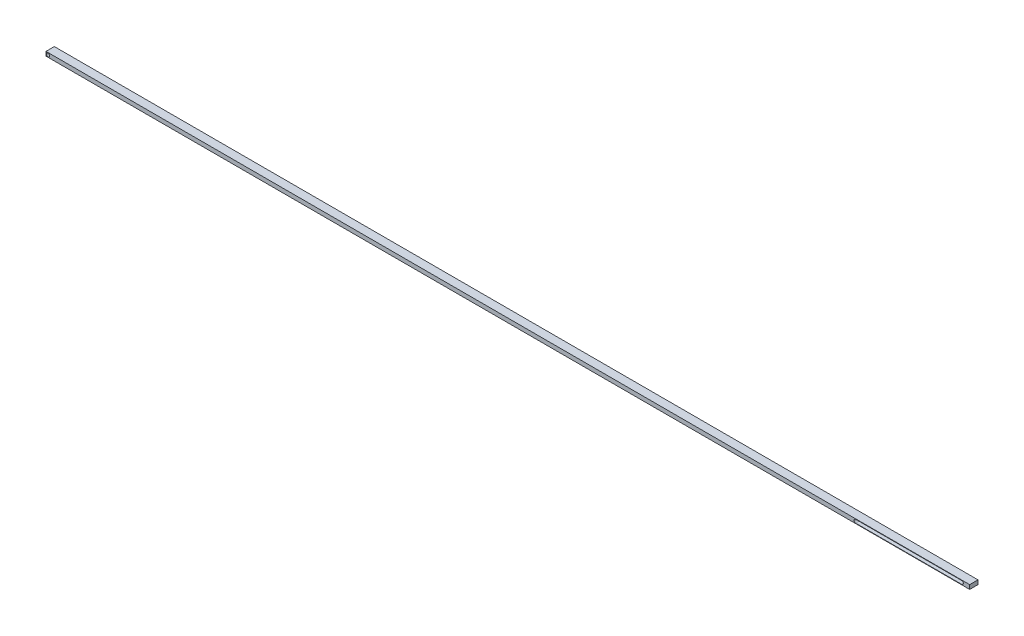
ISO-10303-21;
HEADER;
FILE_DESCRIPTION(('STEP AP214'),'2;1');
FILE_NAME('part.step','',(''),(''),'','','');
FILE_SCHEMA(('AUTOMOTIVE_DESIGN { 1 0 10303 214 1 1 1 1 }'));
ENDSEC;
DATA;
#1=APPLICATION_CONTEXT('core data for automotive mechanical design processes');
#2=APPLICATION_PROTOCOL_DEFINITION('international standard','automotive_design',2000,#1);
#3=PRODUCT_CONTEXT('',#1,'mechanical');
#4=PRODUCT('Part','Part','',(#3));
#5=PRODUCT_RELATED_PRODUCT_CATEGORY('part','',(#4));
#6=PRODUCT_DEFINITION_FORMATION('','',#4);
#7=PRODUCT_DEFINITION_CONTEXT('part definition',#1,'design');
#8=PRODUCT_DEFINITION('design','',#6,#7);
#9=PRODUCT_DEFINITION_SHAPE('','',#8);
#10=(LENGTH_UNIT() NAMED_UNIT(*) SI_UNIT(.MILLI.,.METRE.));
#11=(NAMED_UNIT(*) PLANE_ANGLE_UNIT() SI_UNIT($,.RADIAN.));
#12=(NAMED_UNIT(*) SI_UNIT($,.STERADIAN.) SOLID_ANGLE_UNIT());
#13=UNCERTAINTY_MEASURE_WITH_UNIT(LENGTH_MEASURE(1.E-05),#10,'distance_accuracy_value','');
#14=(GEOMETRIC_REPRESENTATION_CONTEXT(3) GLOBAL_UNCERTAINTY_ASSIGNED_CONTEXT((#13)) GLOBAL_UNIT_ASSIGNED_CONTEXT((#10,
#11,#12)) REPRESENTATION_CONTEXT('',''));
#15=CARTESIAN_POINT('',(0.,0.,0.));
#16=DIRECTION('',(0.,0.,1.));
#17=DIRECTION('',(1.,0.,0.));
#18=AXIS2_PLACEMENT_3D('',#15,#16,#17);
#19=CARTESIAN_POINT('',(0.,0.,20.));
#20=DIRECTION('',(1.,0.,0.));
#21=DIRECTION('',(0.,0.,-1.));
#22=AXIS2_PLACEMENT_3D('',#19,#20,#21);
#23=PLANE('',#22);
#24=DIRECTION('',(0.,-1.,0.));
#25=VECTOR('',#24,1.);
#26=CARTESIAN_POINT('',(0.,0.,0.));
#27=LINE('',#26,#25);
#28=CARTESIAN_POINT('',(0.,10.,0.));
#29=VERTEX_POINT('',#28);
#30=CARTESIAN_POINT('',(0.,0.,0.));
#31=VERTEX_POINT('',#30);
#32=EDGE_CURVE('E145',#29,#31,#27,.T.);
#33=ORIENTED_EDGE('',*,*,#32,.T.);
#34=DIRECTION('',(0.,0.,-1.));
#35=VECTOR('',#34,1.);
#36=CARTESIAN_POINT('',(0.,0.,20.));
#37=LINE('',#36,#35);
#38=CARTESIAN_POINT('',(0.,0.,20.));
#39=VERTEX_POINT('',#38);
#40=EDGE_CURVE('E11',#39,#31,#37,.T.);
#41=ORIENTED_EDGE('',*,*,#40,.F.);
#42=DIRECTION('',(0.,-1.,0.));
#43=VECTOR('',#42,1.);
#44=CARTESIAN_POINT('',(0.,0.,20.));
#45=LINE('',#44,#43);
#46=CARTESIAN_POINT('',(0.,10.,20.));
#47=VERTEX_POINT('',#46);
#48=EDGE_CURVE('E148',#47,#39,#45,.T.);
#49=ORIENTED_EDGE('',*,*,#48,.F.);
#50=DIRECTION('',(0.,0.,-1.));
#51=VECTOR('',#50,1.);
#52=CARTESIAN_POINT('',(0.,10.,20.));
#53=LINE('',#52,#51);
#54=EDGE_CURVE('E158',#47,#29,#53,.T.);
#55=ORIENTED_EDGE('',*,*,#54,.T.);
#56=EDGE_LOOP('',(#33,#41,#49,#55));
#57=FACE_BOUND('',#56,.T.);
#58=ADVANCED_FACE('F41',(#57),#23,.F.);
#59=CARTESIAN_POINT('',(0.,0.,20.));
#60=DIRECTION('',(0.,1.,0.));
#61=DIRECTION('',(0.,0.,1.));
#62=AXIS2_PLACEMENT_3D('',#59,#60,#61);
#63=PLANE('',#62);
#64=DIRECTION('',(1.,0.,0.));
#65=VECTOR('',#64,1.);
#66=CARTESIAN_POINT('',(0.,0.,0.));
#67=LINE('',#66,#65);
#68=CARTESIAN_POINT('',(2220.,0.,0.));
#69=VERTEX_POINT('',#68);
#70=EDGE_CURVE('E161',#31,#69,#67,.T.);
#71=ORIENTED_EDGE('',*,*,#70,.T.);
#72=DIRECTION('',(0.,0.,-1.));
#73=VECTOR('',#72,1.);
#74=CARTESIAN_POINT('',(2220.,0.,20.));
#75=LINE('',#74,#73);
#76=CARTESIAN_POINT('',(2220.,0.,20.));
#77=VERTEX_POINT('',#76);
#78=EDGE_CURVE('E48',#77,#69,#75,.T.);
#79=ORIENTED_EDGE('',*,*,#78,.F.);
#80=DIRECTION('',(1.,0.,0.));
#81=VECTOR('',#80,1.);
#82=CARTESIAN_POINT('',(0.,0.,20.));
#83=LINE('',#82,#81);
#84=EDGE_CURVE('E151',#39,#77,#83,.T.);
#85=ORIENTED_EDGE('',*,*,#84,.F.);
#86=ORIENTED_EDGE('',*,*,#40,.T.);
#87=EDGE_LOOP('',(#71,#79,#85,#86));
#88=FACE_BOUND('',#87,.T.);
#89=ADVANCED_FACE('F190',(#88),#63,.F.);
#90=CARTESIAN_POINT('',(2220.,0.,20.));
#91=DIRECTION('',(-1.,0.,0.));
#92=DIRECTION('',(0.,0.,1.));
#93=AXIS2_PLACEMENT_3D('',#90,#91,#92);
#94=PLANE('',#93);
#95=DIRECTION('',(0.,1.,0.));
#96=VECTOR('',#95,1.);
#97=CARTESIAN_POINT('',(2220.,0.,0.));
#98=LINE('',#97,#96);
#99=CARTESIAN_POINT('',(2220.,10.,0.));
#100=VERTEX_POINT('',#99);
#101=EDGE_CURVE('E163',#69,#100,#98,.T.);
#102=ORIENTED_EDGE('',*,*,#101,.T.);
#103=DIRECTION('',(0.,0.,-1.));
#104=VECTOR('',#103,1.);
#105=CARTESIAN_POINT('',(2220.,10.,20.));
#106=LINE('',#105,#104);
#107=CARTESIAN_POINT('',(2220.,10.,20.));
#108=VERTEX_POINT('',#107);
#109=EDGE_CURVE('E168',#108,#100,#106,.T.);
#110=ORIENTED_EDGE('',*,*,#109,.F.);
#111=DIRECTION('',(0.,1.,0.));
#112=VECTOR('',#111,1.);
#113=CARTESIAN_POINT('',(2220.,0.,20.));
#114=LINE('',#113,#112);
#115=EDGE_CURVE('E154',#77,#108,#114,.T.);
#116=ORIENTED_EDGE('',*,*,#115,.F.);
#117=ORIENTED_EDGE('',*,*,#78,.T.);
#118=EDGE_LOOP('',(#102,#110,#116,#117));
#119=FACE_BOUND('',#118,.T.);
#120=ADVANCED_FACE('F175',(#119),#94,.F.);
#121=CARTESIAN_POINT('',(0.,10.,20.));
#122=DIRECTION('',(0.,-1.,0.));
#123=DIRECTION('',(0.,0.,-1.));
#124=AXIS2_PLACEMENT_3D('',#121,#122,#123);
#125=PLANE('',#124);
#126=DIRECTION('',(-1.,0.,0.));
#127=VECTOR('',#126,1.);
#128=CARTESIAN_POINT('',(0.,10.,0.));
#129=LINE('',#128,#127);
#130=EDGE_CURVE('E152',#100,#29,#129,.T.);
#131=ORIENTED_EDGE('',*,*,#130,.T.);
#132=ORIENTED_EDGE('',*,*,#54,.F.);
#133=DIRECTION('',(-1.,0.,0.));
#134=VECTOR('',#133,1.);
#135=CARTESIAN_POINT('',(0.,10.,20.));
#136=LINE('',#135,#134);
#137=EDGE_CURVE('E156',#108,#47,#136,.T.);
#138=ORIENTED_EDGE('',*,*,#137,.F.);
#139=ORIENTED_EDGE('',*,*,#109,.T.);
#140=EDGE_LOOP('',(#131,#132,#138,#139));
#141=FACE_BOUND('',#140,.T.);
#142=ADVANCED_FACE('F183',(#141),#125,.F.);
#143=CARTESIAN_POINT('',(0.,0.,20.));
#144=DIRECTION('',(0.,0.,-1.));
#145=DIRECTION('',(-1.,0.,0.));
#146=AXIS2_PLACEMENT_3D('',#143,#144,#145);
#147=PLANE('',#146);
#148=DIRECTION('',(-1.,0.,0.));
#149=VECTOR('',#148,1.);
#150=CARTESIAN_POINT('',(2201.,9.,20.));
#151=LINE('',#150,#149);
#152=CARTESIAN_POINT('',(2201.,9.,20.));
#153=VERTEX_POINT('',#152);
#154=CARTESIAN_POINT('',(1946.,8.99999999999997,20.));
#155=VERTEX_POINT('',#154);
#156=EDGE_CURVE('E132',#153,#155,#151,.T.);
#157=ORIENTED_EDGE('',*,*,#156,.F.);
#158=CARTESIAN_POINT('',(2201.,5.,20.));
#159=DIRECTION('',(0.,0.,1.));
#160=DIRECTION('',(1.,0.,0.));
#161=AXIS2_PLACEMENT_3D('',#158,#159,#160);
#162=CIRCLE('',#161,4.);
#163=CARTESIAN_POINT('',(2201.,0.999999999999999,20.));
#164=VERTEX_POINT('',#163);
#165=EDGE_CURVE('E55',#164,#153,#162,.T.);
#166=ORIENTED_EDGE('',*,*,#165,.F.);
#167=DIRECTION('',(1.,0.,0.));
#168=VECTOR('',#167,1.);
#169=CARTESIAN_POINT('',(2201.,0.999999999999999,20.));
#170=LINE('',#169,#168);
#171=CARTESIAN_POINT('',(1946.,0.999999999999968,20.));
#172=VERTEX_POINT('',#171);
#173=EDGE_CURVE('E123',#172,#164,#170,.T.);
#174=ORIENTED_EDGE('',*,*,#173,.F.);
#175=CARTESIAN_POINT('',(1946.,4.99999999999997,20.));
#176=DIRECTION('',(0.,0.,1.));
#177=DIRECTION('',(1.,0.,0.));
#178=AXIS2_PLACEMENT_3D('',#175,#176,#177);
#179=CIRCLE('',#178,4.);
#180=EDGE_CURVE('E126',#155,#172,#179,.T.);
#181=ORIENTED_EDGE('',*,*,#180,.F.);
#182=EDGE_LOOP('',(#157,#166,#174,#181));
#183=FACE_BOUND('',#182,.T.);
#184=CARTESIAN_POINT('',(5.,5.,20.));
#185=DIRECTION('',(0.,0.,1.));
#186=DIRECTION('',(1.,0.,0.));
#187=AXIS2_PLACEMENT_3D('',#184,#185,#186);
#188=CIRCLE('',#187,4.);
#189=CARTESIAN_POINT('',(9.,5.,20.));
#190=VERTEX_POINT('',#189);
#191=EDGE_CURVE('E138',#190,#190,#188,.T.);
#192=ORIENTED_EDGE('',*,*,#191,.F.);
#193=EDGE_LOOP('',(#192));
#194=FACE_BOUND('',#193,.T.);
#195=ORIENTED_EDGE('',*,*,#48,.T.);
#196=ORIENTED_EDGE('',*,*,#84,.T.);
#197=ORIENTED_EDGE('',*,*,#115,.T.);
#198=ORIENTED_EDGE('',*,*,#137,.T.);
#199=EDGE_LOOP('',(#195,#196,#197,#198));
#200=FACE_BOUND('',#199,.T.);
#201=ADVANCED_FACE('F189',(#183,#194,#200),#147,.F.);
#202=CARTESIAN_POINT('',(0.,0.,0.));
#203=DIRECTION('',(0.,0.,-1.));
#204=DIRECTION('',(-1.,0.,0.));
#205=AXIS2_PLACEMENT_3D('',#202,#203,#204);
#206=PLANE('',#205);
#207=CARTESIAN_POINT('',(2201.,5.,0.));
#208=DIRECTION('',(0.,0.,1.));
#209=DIRECTION('',(1.,0.,0.));
#210=AXIS2_PLACEMENT_3D('',#207,#208,#209);
#211=CIRCLE('',#210,4.);
#212=CARTESIAN_POINT('',(2201.,0.999999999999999,0.));
#213=VERTEX_POINT('',#212);
#214=CARTESIAN_POINT('',(2201.,9.,0.));
#215=VERTEX_POINT('',#214);
#216=EDGE_CURVE('E107',#213,#215,#211,.T.);
#217=ORIENTED_EDGE('',*,*,#216,.T.);
#218=DIRECTION('',(-1.,0.,0.));
#219=VECTOR('',#218,1.);
#220=CARTESIAN_POINT('',(2201.,9.,0.));
#221=LINE('',#220,#219);
#222=CARTESIAN_POINT('',(1946.,8.99999999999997,0.));
#223=VERTEX_POINT('',#222);
#224=EDGE_CURVE('E116',#215,#223,#221,.T.);
#225=ORIENTED_EDGE('',*,*,#224,.T.);
#226=CARTESIAN_POINT('',(1946.,4.99999999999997,0.));
#227=DIRECTION('',(0.,0.,1.));
#228=DIRECTION('',(1.,0.,0.));
#229=AXIS2_PLACEMENT_3D('',#226,#227,#228);
#230=CIRCLE('',#229,4.);
#231=CARTESIAN_POINT('',(1946.,0.999999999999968,0.));
#232=VERTEX_POINT('',#231);
#233=EDGE_CURVE('E63',#223,#232,#230,.T.);
#234=ORIENTED_EDGE('',*,*,#233,.T.);
#235=DIRECTION('',(1.,0.,0.));
#236=VECTOR('',#235,1.);
#237=CARTESIAN_POINT('',(2201.,0.999999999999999,0.));
#238=LINE('',#237,#236);
#239=EDGE_CURVE('E113',#232,#213,#238,.T.);
#240=ORIENTED_EDGE('',*,*,#239,.T.);
#241=EDGE_LOOP('',(#217,#225,#234,#240));
#242=FACE_BOUND('',#241,.T.);
#243=CARTESIAN_POINT('',(5.,5.,0.));
#244=DIRECTION('',(0.,0.,1.));
#245=DIRECTION('',(1.,0.,0.));
#246=AXIS2_PLACEMENT_3D('',#243,#244,#245);
#247=CIRCLE('',#246,4.);
#248=CARTESIAN_POINT('',(9.,5.,0.));
#249=VERTEX_POINT('',#248);
#250=EDGE_CURVE('E142',#249,#249,#247,.T.);
#251=ORIENTED_EDGE('',*,*,#250,.T.);
#252=EDGE_LOOP('',(#251));
#253=FACE_BOUND('',#252,.T.);
#254=ORIENTED_EDGE('',*,*,#32,.F.);
#255=ORIENTED_EDGE('',*,*,#130,.F.);
#256=ORIENTED_EDGE('',*,*,#101,.F.);
#257=ORIENTED_EDGE('',*,*,#70,.F.);
#258=EDGE_LOOP('',(#254,#255,#256,#257));
#259=FACE_BOUND('',#258,.T.);
#260=ADVANCED_FACE('F120',(#242,#253,#259),#206,.T.);
#261=CARTESIAN_POINT('',(5.,5.,0.));
#262=DIRECTION('',(0.,0.,1.));
#263=DIRECTION('',(1.,0.,0.));
#264=AXIS2_PLACEMENT_3D('',#261,#262,#263);
#265=CYLINDRICAL_SURFACE('',#264,4.);
#266=ORIENTED_EDGE('',*,*,#250,.F.);
#267=EDGE_LOOP('',(#266));
#268=FACE_BOUND('',#267,.T.);
#269=ORIENTED_EDGE('',*,*,#191,.T.);
#270=EDGE_LOOP('',(#269));
#271=FACE_BOUND('',#270,.T.);
#272=ADVANCED_FACE('F202',(#268,#271),#265,.F.);
#273=CARTESIAN_POINT('',(2201.,5.,0.));
#274=DIRECTION('',(0.,0.,1.));
#275=DIRECTION('',(1.,0.,0.));
#276=AXIS2_PLACEMENT_3D('',#273,#274,#275);
#277=CYLINDRICAL_SURFACE('',#276,4.);
#278=ORIENTED_EDGE('',*,*,#165,.T.);
#279=DIRECTION('',(0.,0.,1.));
#280=VECTOR('',#279,1.);
#281=CARTESIAN_POINT('',(2201.,9.,0.));
#282=LINE('',#281,#280);
#283=EDGE_CURVE('E103',#215,#153,#282,.T.);
#284=ORIENTED_EDGE('',*,*,#283,.F.);
#285=ORIENTED_EDGE('',*,*,#216,.F.);
#286=DIRECTION('',(0.,0.,1.));
#287=VECTOR('',#286,1.);
#288=CARTESIAN_POINT('',(2201.,0.999999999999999,0.));
#289=LINE('',#288,#287);
#290=EDGE_CURVE('E136',#213,#164,#289,.T.);
#291=ORIENTED_EDGE('',*,*,#290,.T.);
#292=EDGE_LOOP('',(#278,#284,#285,#291));
#293=FACE_BOUND('',#292,.T.);
#294=ADVANCED_FACE('F105',(#293),#277,.F.);
#295=CARTESIAN_POINT('',(2201.,0.999999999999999,0.));
#296=DIRECTION('',(0.,-1.,0.));
#297=DIRECTION('',(1.,0.,0.));
#298=AXIS2_PLACEMENT_3D('',#295,#296,#297);
#299=PLANE('',#298);
#300=ORIENTED_EDGE('',*,*,#173,.T.);
#301=ORIENTED_EDGE('',*,*,#290,.F.);
#302=ORIENTED_EDGE('',*,*,#239,.F.);
#303=DIRECTION('',(0.,0.,1.));
#304=VECTOR('',#303,1.);
#305=CARTESIAN_POINT('',(1946.,0.999999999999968,0.));
#306=LINE('',#305,#304);
#307=EDGE_CURVE('E139',#232,#172,#306,.T.);
#308=ORIENTED_EDGE('',*,*,#307,.T.);
#309=EDGE_LOOP('',(#300,#301,#302,#308));
#310=FACE_BOUND('',#309,.T.);
#311=ADVANCED_FACE('F211',(#310),#299,.F.);
#312=CARTESIAN_POINT('',(1946.,4.99999999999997,0.));
#313=DIRECTION('',(0.,0.,1.));
#314=DIRECTION('',(1.,0.,0.));
#315=AXIS2_PLACEMENT_3D('',#312,#313,#314);
#316=CYLINDRICAL_SURFACE('',#315,4.);
#317=ORIENTED_EDGE('',*,*,#180,.T.);
#318=ORIENTED_EDGE('',*,*,#307,.F.);
#319=ORIENTED_EDGE('',*,*,#233,.F.);
#320=DIRECTION('',(0.,0.,1.));
#321=VECTOR('',#320,1.);
#322=CARTESIAN_POINT('',(1946.,8.99999999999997,0.));
#323=LINE('',#322,#321);
#324=EDGE_CURVE('E112',#223,#155,#323,.T.);
#325=ORIENTED_EDGE('',*,*,#324,.T.);
#326=EDGE_LOOP('',(#317,#318,#319,#325));
#327=FACE_BOUND('',#326,.T.);
#328=ADVANCED_FACE('F214',(#327),#316,.F.);
#329=CARTESIAN_POINT('',(2201.,9.,0.));
#330=DIRECTION('',(0.,1.,0.));
#331=DIRECTION('',(-1.,0.,0.));
#332=AXIS2_PLACEMENT_3D('',#329,#330,#331);
#333=PLANE('',#332);
#334=ORIENTED_EDGE('',*,*,#156,.T.);
#335=ORIENTED_EDGE('',*,*,#324,.F.);
#336=ORIENTED_EDGE('',*,*,#224,.F.);
#337=ORIENTED_EDGE('',*,*,#283,.T.);
#338=EDGE_LOOP('',(#334,#335,#336,#337));
#339=FACE_BOUND('',#338,.T.);
#340=ADVANCED_FACE('F117',(#339),#333,.F.);
#341=CLOSED_SHELL('',(#58,#89,#120,#142,#201,#260,#272,#294,#311,#328,#340));
#342=MANIFOLD_SOLID_BREP('B2',#341);
#343=ADVANCED_BREP_SHAPE_REPRESENTATION('',(#18,#342),#14);
#344=SHAPE_DEFINITION_REPRESENTATION(#9,#343);
ENDSEC;
END-ISO-10303-21;
